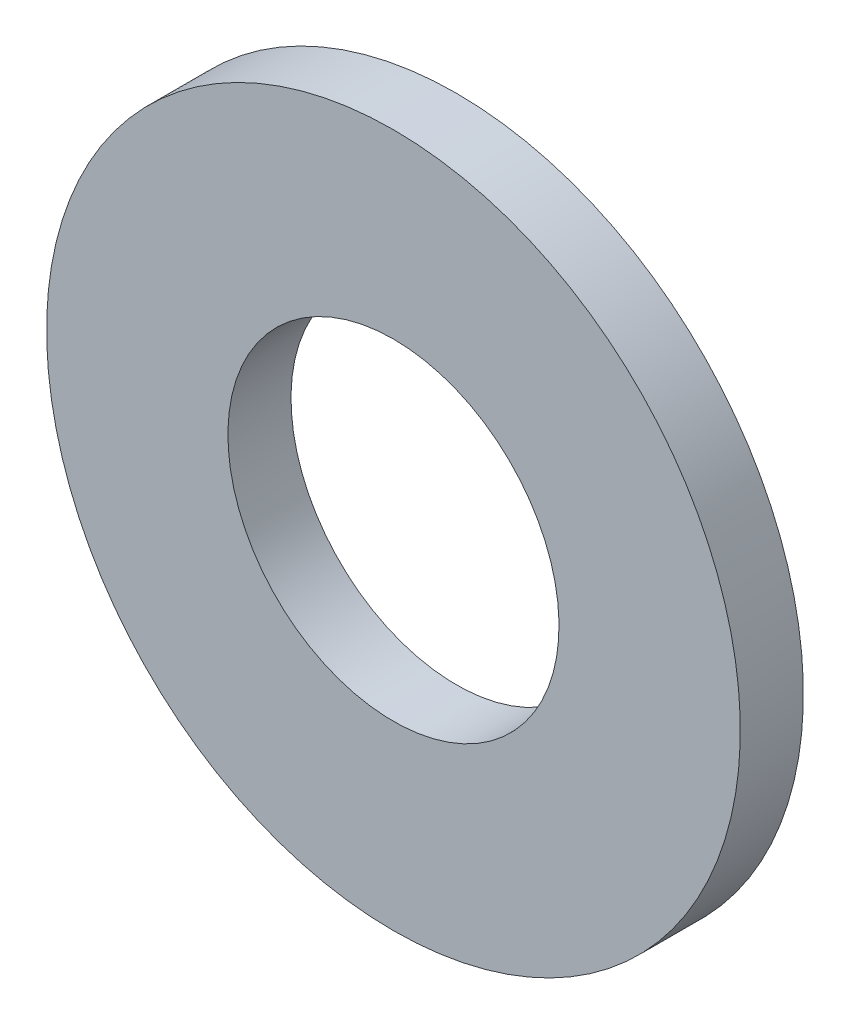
ISO-10303-21;
HEADER;
FILE_DESCRIPTION(('STEP AP214'),'2;1');
FILE_NAME('part.step','',(''),(''),'','','');
FILE_SCHEMA(('AUTOMOTIVE_DESIGN { 1 0 10303 214 1 1 1 1 }'));
ENDSEC;
DATA;
#1=APPLICATION_CONTEXT('core data for automotive mechanical design processes');
#2=APPLICATION_PROTOCOL_DEFINITION('international standard','automotive_design',2000,#1);
#3=PRODUCT_CONTEXT('',#1,'mechanical');
#4=PRODUCT('Part','Part','',(#3));
#5=PRODUCT_RELATED_PRODUCT_CATEGORY('part','',(#4));
#6=PRODUCT_DEFINITION_FORMATION('','',#4);
#7=PRODUCT_DEFINITION_CONTEXT('part definition',#1,'design');
#8=PRODUCT_DEFINITION('design','',#6,#7);
#9=PRODUCT_DEFINITION_SHAPE('','',#8);
#10=(LENGTH_UNIT() NAMED_UNIT(*) SI_UNIT(.MILLI.,.METRE.));
#11=(NAMED_UNIT(*) PLANE_ANGLE_UNIT() SI_UNIT($,.RADIAN.));
#12=(NAMED_UNIT(*) SI_UNIT($,.STERADIAN.) SOLID_ANGLE_UNIT());
#13=UNCERTAINTY_MEASURE_WITH_UNIT(LENGTH_MEASURE(1.E-05),#10,'distance_accuracy_value','');
#14=(GEOMETRIC_REPRESENTATION_CONTEXT(3) GLOBAL_UNCERTAINTY_ASSIGNED_CONTEXT((#13)) GLOBAL_UNIT_ASSIGNED_CONTEXT((#10,
#11,#12)) REPRESENTATION_CONTEXT('',''));
#15=CARTESIAN_POINT('',(0.,0.,0.));
#16=DIRECTION('',(0.,0.,1.));
#17=DIRECTION('',(1.,0.,0.));
#18=AXIS2_PLACEMENT_3D('',#15,#16,#17);
#19=CARTESIAN_POINT('',(0.,0.,0.));
#20=DIRECTION('',(0.,0.,-1.));
#21=DIRECTION('',(0.,1.,0.));
#22=AXIS2_PLACEMENT_3D('',#19,#20,#21);
#23=CYLINDRICAL_SURFACE('',#22,5.25);
#24=CARTESIAN_POINT('',(0.,0.,2.));
#25=DIRECTION('',(0.,0.,-1.));
#26=DIRECTION('',(0.,1.,0.));
#27=AXIS2_PLACEMENT_3D('',#24,#25,#26);
#28=CIRCLE('',#27,5.25);
#29=CARTESIAN_POINT('',(0.,5.25,2.));
#30=VERTEX_POINT('',#29);
#31=EDGE_CURVE('E10',#30,#30,#28,.T.);
#32=ORIENTED_EDGE('',*,*,#31,.F.);
#33=EDGE_LOOP('',(#32));
#34=FACE_BOUND('',#33,.T.);
#35=CARTESIAN_POINT('',(0.,0.,0.));
#36=DIRECTION('',(0.,0.,-1.));
#37=DIRECTION('',(0.,1.,0.));
#38=AXIS2_PLACEMENT_3D('',#35,#36,#37);
#39=CIRCLE('',#38,5.25);
#40=CARTESIAN_POINT('',(0.,5.25,0.));
#41=VERTEX_POINT('',#40);
#42=EDGE_CURVE('E28',#41,#41,#39,.T.);
#43=ORIENTED_EDGE('',*,*,#42,.T.);
#44=EDGE_LOOP('',(#43));
#45=FACE_BOUND('',#44,.T.);
#46=ADVANCED_FACE('F14',(#34,#45),#23,.F.);
#47=CARTESIAN_POINT('',(11.,0.,2.));
#48=DIRECTION('',(0.,0.,1.));
#49=DIRECTION('',(0.,-1.,0.));
#50=AXIS2_PLACEMENT_3D('',#47,#48,#49);
#51=PLANE('',#50);
#52=ORIENTED_EDGE('',*,*,#31,.T.);
#53=EDGE_LOOP('',(#52));
#54=FACE_BOUND('',#53,.T.);
#55=CARTESIAN_POINT('',(0.,0.,2.));
#56=DIRECTION('',(0.,0.,-1.));
#57=DIRECTION('',(0.,1.,0.));
#58=AXIS2_PLACEMENT_3D('',#55,#56,#57);
#59=CIRCLE('',#58,11.);
#60=CARTESIAN_POINT('',(0.,11.,2.));
#61=VERTEX_POINT('',#60);
#62=EDGE_CURVE('E20',#61,#61,#59,.T.);
#63=ORIENTED_EDGE('',*,*,#62,.F.);
#64=EDGE_LOOP('',(#63));
#65=FACE_BOUND('',#64,.T.);
#66=ADVANCED_FACE('F44',(#54,#65),#51,.T.);
#67=CARTESIAN_POINT('',(0.,0.,0.));
#68=DIRECTION('',(0.,0.,-1.));
#69=DIRECTION('',(0.,1.,0.));
#70=AXIS2_PLACEMENT_3D('',#67,#68,#69);
#71=CYLINDRICAL_SURFACE('',#70,11.);
#72=ORIENTED_EDGE('',*,*,#62,.T.);
#73=EDGE_LOOP('',(#72));
#74=FACE_BOUND('',#73,.T.);
#75=CARTESIAN_POINT('',(0.,0.,0.));
#76=DIRECTION('',(0.,0.,-1.));
#77=DIRECTION('',(0.,1.,0.));
#78=AXIS2_PLACEMENT_3D('',#75,#76,#77);
#79=CIRCLE('',#78,11.);
#80=CARTESIAN_POINT('',(0.,11.,0.));
#81=VERTEX_POINT('',#80);
#82=EDGE_CURVE('E24',#81,#81,#79,.T.);
#83=ORIENTED_EDGE('',*,*,#82,.F.);
#84=EDGE_LOOP('',(#83));
#85=FACE_BOUND('',#84,.T.);
#86=ADVANCED_FACE('F37',(#74,#85),#71,.T.);
#87=CARTESIAN_POINT('',(5.25,0.,0.));
#88=DIRECTION('',(0.,0.,-1.));
#89=DIRECTION('',(0.,1.,0.));
#90=AXIS2_PLACEMENT_3D('',#87,#88,#89);
#91=PLANE('',#90);
#92=ORIENTED_EDGE('',*,*,#82,.T.);
#93=EDGE_LOOP('',(#92));
#94=FACE_BOUND('',#93,.T.);
#95=ORIENTED_EDGE('',*,*,#42,.F.);
#96=EDGE_LOOP('',(#95));
#97=FACE_BOUND('',#96,.T.);
#98=ADVANCED_FACE('F35',(#94,#97),#91,.T.);
#99=CLOSED_SHELL('',(#46,#66,#86,#98));
#100=MANIFOLD_SOLID_BREP('B1',#99);
#101=ADVANCED_BREP_SHAPE_REPRESENTATION('',(#18,#100),#14);
#102=SHAPE_DEFINITION_REPRESENTATION(#9,#101);
ENDSEC;
END-ISO-10303-21;
